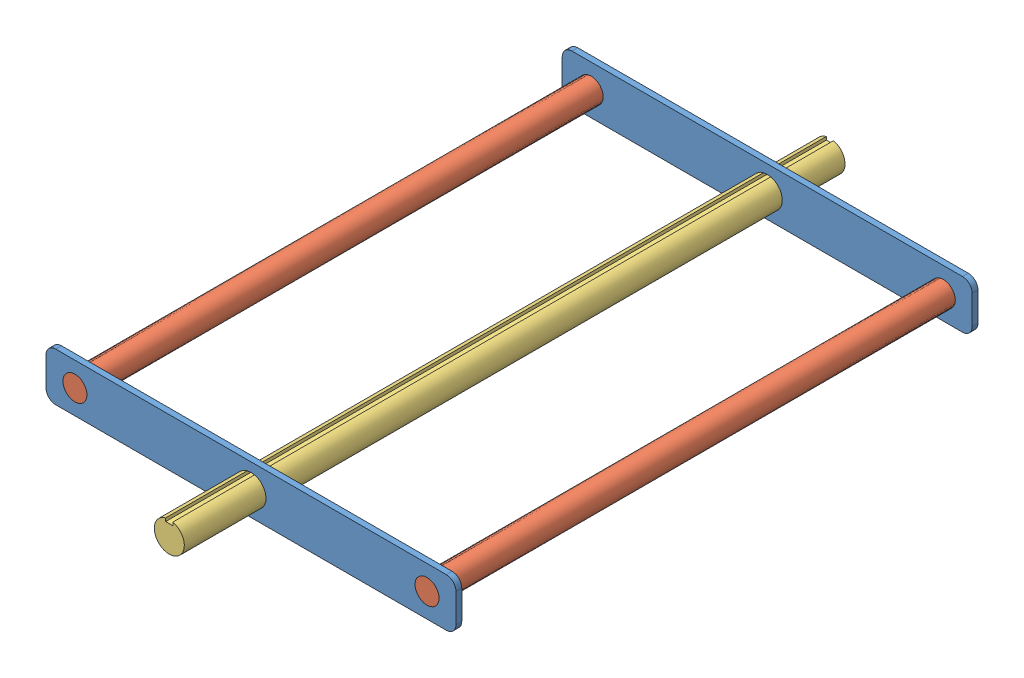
SolidWorks assembly Kicker Sub-assembly.SLDASM, configuration Default (file format 4400). Lengths in mm.
Overall size (215.9 25.4 347.93).
5 component instances, 3 part files, 9 mates.
Components (placement in the parent):
- Shaft Bracket-1: Shaft Bracket.SLDPRT [Default] at (-0.7031 1.3439 -0.542) size (215.9 25.4 3.05)
- Shaft Bracket-2: Shaft Bracket.SLDPRT [Default] at (-0.7031 1.3439 271.3117) size (215.9 25.4 3.05)
- Kicking Shaft-1: Kicking Shaft.SLDPRT [Default] at (92.0069 1.3439 135.3848) size (12.7 12.7 274.9)
- Kicking Shaft-2: Kicking Shaft.SLDPRT [Default] at (-93.4131 1.3439 135.3848) size (12.7 12.7 274.9)
- Main Shaft-1: Main Shaft.SLDPRT [Default] at (-0.7031 1.3439 141.8973) size (15.88 15.64 347.93)
Mates (geometry in assembly coordinates):
- Concentric1: concentric aligned: cylinder of Shaft Bracket-2 through (92.0069 1.3439 272.8357) axis (0 0 -1) radius 6.35; cylinder of Kicking Shaft-1 through (92.0069 1.3439 272.8357) axis (0 0 -1) radius 6.35
- Concentric2: concentric aligned: cylinder of Shaft Bracket-2 through (-93.4131 1.3439 272.8357) axis (0 0 -1) radius 6.35; cylinder of Kicking Shaft-2 through (-93.4131 1.3439 272.8357) axis (0 0 -1) radius 6.35
- Coincident1: coincident aligned: plane of Shaft Bracket-2 through (-108.6531 -11.3561 272.8357) normal (0 0 1); plane of Kicking Shaft-2 through (-93.4131 1.3439 272.8357) normal (0 0 1)
- Coincident2: coincident aligned: plane of Shaft Bracket-2 through (-108.6531 -11.3561 272.8357) normal (0 0 1); plane of Kicking Shaft-1 through (92.0069 1.3439 272.8357) normal (0 0 1)
- Concentric3: concentric aligned: cylinder of Shaft Bracket-1 through (92.0069 1.3439 0.982) axis (0 0 -1) radius 6.35; cylinder of Kicking Shaft-1 through (92.0069 1.3439 272.8357) axis (0 0 -1) radius 6.35
- Concentric4: concentric aligned: cylinder of Shaft Bracket-1 through (-93.4131 1.3439 0.982) axis (0 0 -1) radius 6.35; cylinder of Kicking Shaft-2 through (-93.4131 1.3439 272.8357) axis (0 0 -1) radius 6.35
- Coincident3: coincident aligned: plane of Shaft Bracket-1 through (-108.6531 -11.3561 -2.066) normal (0 0 -1); plane of Kicking Shaft-1 through (92.0069 1.3439 -2.066) normal (0 0 -1)
- Concentric5: concentric aligned: cylinder of Shaft Bracket-1 through (-0.7031 1.3439 0.982) axis (0 0 -1) radius 7.874; cylinder of Main Shaft-1 through (-0.7031 1.3439 315.8607) axis (0 0 -1) radius 7.9375
- Distance2: distance = 30 mm aligned: plane of Main Shaft-1 through (-0.7031 1.3439 -32.066) normal (0 0 -1); plane of Shaft Bracket-1 through (-108.6531 -11.3561 -2.066) normal (0 0 -1)
